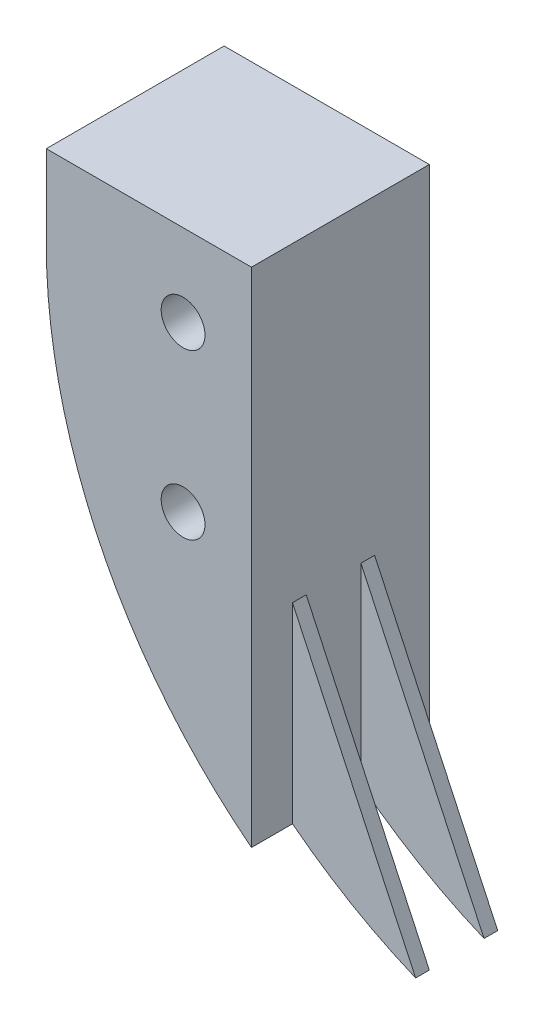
ISO-10303-21;
HEADER;
FILE_DESCRIPTION(('STEP AP214'),'2;1');
FILE_NAME('part.step','',(''),(''),'','','');
FILE_SCHEMA(('AUTOMOTIVE_DESIGN { 1 0 10303 214 1 1 1 1 }'));
ENDSEC;
DATA;
#1=APPLICATION_CONTEXT('core data for automotive mechanical design processes');
#2=APPLICATION_PROTOCOL_DEFINITION('international standard','automotive_design',2000,#1);
#3=PRODUCT_CONTEXT('',#1,'mechanical');
#4=PRODUCT('Part','Part','',(#3));
#5=PRODUCT_RELATED_PRODUCT_CATEGORY('part','',(#4));
#6=PRODUCT_DEFINITION_FORMATION('','',#4);
#7=PRODUCT_DEFINITION_CONTEXT('part definition',#1,'design');
#8=PRODUCT_DEFINITION('design','',#6,#7);
#9=PRODUCT_DEFINITION_SHAPE('','',#8);
#10=(LENGTH_UNIT() NAMED_UNIT(*) SI_UNIT(.MILLI.,.METRE.));
#11=(NAMED_UNIT(*) PLANE_ANGLE_UNIT() SI_UNIT($,.RADIAN.));
#12=(NAMED_UNIT(*) SI_UNIT($,.STERADIAN.) SOLID_ANGLE_UNIT());
#13=UNCERTAINTY_MEASURE_WITH_UNIT(LENGTH_MEASURE(1.E-05),#10,'distance_accuracy_value','');
#14=(GEOMETRIC_REPRESENTATION_CONTEXT(3) GLOBAL_UNCERTAINTY_ASSIGNED_CONTEXT((#13)) GLOBAL_UNIT_ASSIGNED_CONTEXT((#10,
#11,#12)) REPRESENTATION_CONTEXT('',''));
#15=CARTESIAN_POINT('',(0.,0.,0.));
#16=DIRECTION('',(0.,0.,1.));
#17=DIRECTION('',(1.,0.,0.));
#18=AXIS2_PLACEMENT_3D('',#15,#16,#17);
#19=CARTESIAN_POINT('',(23.,71.,26.3424433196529));
#20=DIRECTION('',(-1.,0.,0.));
#21=DIRECTION('',(0.,0.,1.));
#22=AXIS2_PLACEMENT_3D('',#19,#20,#21);
#23=PLANE('',#22);
#24=DIRECTION('',(0.,-1.,0.));
#25=VECTOR('',#24,1.);
#26=CARTESIAN_POINT('',(23.,59.6295738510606,2.));
#27=LINE('',#26,#25);
#28=CARTESIAN_POINT('',(23.,59.6295738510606,2.));
#29=VERTEX_POINT('',#28);
#30=CARTESIAN_POINT('',(23.,52.6295738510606,2.));
#31=VERTEX_POINT('',#30);
#32=EDGE_CURVE('E143',#29,#31,#27,.T.);
#33=ORIENTED_EDGE('',*,*,#32,.T.);
#34=DIRECTION('',(0.,0.,-1.));
#35=VECTOR('',#34,1.);
#36=CARTESIAN_POINT('',(23.,52.6295738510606,26.3424433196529));
#37=LINE('',#36,#35);
#38=CARTESIAN_POINT('',(23.,52.6295738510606,0.));
#39=VERTEX_POINT('',#38);
#40=EDGE_CURVE('E39',#31,#39,#37,.T.);
#41=ORIENTED_EDGE('',*,*,#40,.T.);
#42=DIRECTION('',(0.,1.,0.));
#43=VECTOR('',#42,1.);
#44=CARTESIAN_POINT('',(23.,71.,0.));
#45=LINE('',#44,#43);
#46=CARTESIAN_POINT('',(23.,71.,0.));
#47=VERTEX_POINT('',#46);
#48=EDGE_CURVE('E197',#39,#47,#45,.T.);
#49=ORIENTED_EDGE('',*,*,#48,.T.);
#50=DIRECTION('',(0.,0.,-1.));
#51=VECTOR('',#50,1.);
#52=CARTESIAN_POINT('',(23.,71.,26.3424433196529));
#53=LINE('',#52,#51);
#54=CARTESIAN_POINT('',(23.,71.,6.5));
#55=VERTEX_POINT('',#54);
#56=EDGE_CURVE('E201',#55,#47,#53,.T.);
#57=ORIENTED_EDGE('',*,*,#56,.F.);
#58=DIRECTION('',(0.,1.,0.));
#59=VECTOR('',#58,1.);
#60=CARTESIAN_POINT('',(23.,71.,6.5));
#61=LINE('',#60,#59);
#62=CARTESIAN_POINT('',(23.,52.6295738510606,6.5));
#63=VERTEX_POINT('',#62);
#64=EDGE_CURVE('E45',#63,#55,#61,.T.);
#65=ORIENTED_EDGE('',*,*,#64,.F.);
#66=CARTESIAN_POINT('',(23.,52.6295738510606,5.));
#67=VERTEX_POINT('',#66);
#68=EDGE_CURVE('E190',#63,#67,#37,.T.);
#69=ORIENTED_EDGE('',*,*,#68,.T.);
#70=DIRECTION('',(0.,-1.,0.));
#71=VECTOR('',#70,1.);
#72=CARTESIAN_POINT('',(23.,59.6295738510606,5.));
#73=LINE('',#72,#71);
#74=CARTESIAN_POINT('',(23.,59.6295738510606,5.));
#75=VERTEX_POINT('',#74);
#76=EDGE_CURVE('E173',#75,#67,#73,.T.);
#77=ORIENTED_EDGE('',*,*,#76,.F.);
#78=DIRECTION('',(0.,0.,1.));
#79=VECTOR('',#78,1.);
#80=CARTESIAN_POINT('',(23.,59.6295738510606,4.5));
#81=LINE('',#80,#79);
#82=CARTESIAN_POINT('',(23.,59.6295738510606,4.5));
#83=VERTEX_POINT('',#82);
#84=EDGE_CURVE('E236',#83,#75,#81,.T.);
#85=ORIENTED_EDGE('',*,*,#84,.F.);
#86=DIRECTION('',(0.,-1.,0.));
#87=VECTOR('',#86,1.);
#88=CARTESIAN_POINT('',(23.,59.6295738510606,4.5));
#89=LINE('',#88,#87);
#90=CARTESIAN_POINT('',(23.,52.6295738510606,4.5));
#91=VERTEX_POINT('',#90);
#92=EDGE_CURVE('E161',#83,#91,#89,.T.);
#93=ORIENTED_EDGE('',*,*,#92,.T.);
#94=CARTESIAN_POINT('',(23.,52.6295738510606,2.5));
#95=VERTEX_POINT('',#94);
#96=EDGE_CURVE('E198',#91,#95,#37,.T.);
#97=ORIENTED_EDGE('',*,*,#96,.T.);
#98=DIRECTION('',(0.,-1.,0.));
#99=VECTOR('',#98,1.);
#100=CARTESIAN_POINT('',(23.,59.6295738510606,2.5));
#101=LINE('',#100,#99);
#102=CARTESIAN_POINT('',(23.,59.6295738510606,2.5));
#103=VERTEX_POINT('',#102);
#104=EDGE_CURVE('E58',#103,#95,#101,.T.);
#105=ORIENTED_EDGE('',*,*,#104,.F.);
#106=DIRECTION('',(0.,0.,1.));
#107=VECTOR('',#106,1.);
#108=CARTESIAN_POINT('',(23.,59.6295738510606,2.));
#109=LINE('',#108,#107);
#110=EDGE_CURVE('E53',#29,#103,#109,.T.);
#111=ORIENTED_EDGE('',*,*,#110,.F.);
#112=EDGE_LOOP('',(#33,#41,#49,#57,#65,#69,#77,#85,#93,#97,#105,#111));
#113=FACE_BOUND('',#112,.T.);
#114=ADVANCED_FACE('F35',(#113),#23,.F.);
#115=CARTESIAN_POINT('',(35.,68.,26.3424433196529));
#116=DIRECTION('',(0.,0.,-1.));
#117=DIRECTION('',(-1.,0.,0.));
#118=AXIS2_PLACEMENT_3D('',#115,#116,#117);
#119=CYLINDRICAL_SURFACE('',#118,19.5);
#120=CARTESIAN_POINT('',(35.,68.,6.5));
#121=DIRECTION('',(0.,0.,1.));
#122=DIRECTION('',(1.,0.,0.));
#123=AXIS2_PLACEMENT_3D('',#120,#121,#122);
#124=CIRCLE('',#123,19.5);
#125=CARTESIAN_POINT('',(15.5,68.,6.5));
#126=VERTEX_POINT('',#125);
#127=EDGE_CURVE('E231',#126,#63,#124,.T.);
#128=ORIENTED_EDGE('',*,*,#127,.F.);
#129=DIRECTION('',(0.,0.,-1.));
#130=VECTOR('',#129,1.);
#131=CARTESIAN_POINT('',(15.5,68.,26.3424433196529));
#132=LINE('',#131,#130);
#133=CARTESIAN_POINT('',(15.5,68.,0.));
#134=VERTEX_POINT('',#133);
#135=EDGE_CURVE('E205',#126,#134,#132,.T.);
#136=ORIENTED_EDGE('',*,*,#135,.T.);
#137=CARTESIAN_POINT('',(35.,68.,0.));
#138=DIRECTION('',(0.,0.,1.));
#139=DIRECTION('',(1.,0.,0.));
#140=AXIS2_PLACEMENT_3D('',#137,#138,#139);
#141=CIRCLE('',#140,19.5);
#142=EDGE_CURVE('E228',#134,#39,#141,.T.);
#143=ORIENTED_EDGE('',*,*,#142,.T.);
#144=ORIENTED_EDGE('',*,*,#40,.F.);
#145=CARTESIAN_POINT('',(35.,68.,2.));
#146=DIRECTION('',(0.,0.,1.));
#147=DIRECTION('',(1.,0.,0.));
#148=AXIS2_PLACEMENT_3D('',#145,#146,#147);
#149=CIRCLE('',#148,19.5);
#150=CARTESIAN_POINT('',(27.5,50.,2.));
#151=VERTEX_POINT('',#150);
#152=EDGE_CURVE('E146',#31,#151,#149,.T.);
#153=ORIENTED_EDGE('',*,*,#152,.T.);
#154=DIRECTION('',(0.,0.,1.));
#155=VECTOR('',#154,1.);
#156=CARTESIAN_POINT('',(27.5,50.,2.));
#157=LINE('',#156,#155);
#158=CARTESIAN_POINT('',(27.5,50.,2.5));
#159=VERTEX_POINT('',#158);
#160=EDGE_CURVE('E154',#151,#159,#157,.T.);
#161=ORIENTED_EDGE('',*,*,#160,.T.);
#162=CARTESIAN_POINT('',(35.,68.,2.5));
#163=DIRECTION('',(0.,0.,1.));
#164=DIRECTION('',(1.,0.,0.));
#165=AXIS2_PLACEMENT_3D('',#162,#163,#164);
#166=CIRCLE('',#165,19.5);
#167=EDGE_CURVE('E144',#95,#159,#166,.T.);
#168=ORIENTED_EDGE('',*,*,#167,.F.);
#169=ORIENTED_EDGE('',*,*,#96,.F.);
#170=CARTESIAN_POINT('',(35.,68.,4.5));
#171=DIRECTION('',(0.,0.,1.));
#172=DIRECTION('',(1.,0.,0.));
#173=AXIS2_PLACEMENT_3D('',#170,#171,#172);
#174=CIRCLE('',#173,19.5);
#175=CARTESIAN_POINT('',(27.5,50.,4.5));
#176=VERTEX_POINT('',#175);
#177=EDGE_CURVE('E170',#91,#176,#174,.T.);
#178=ORIENTED_EDGE('',*,*,#177,.T.);
#179=DIRECTION('',(0.,0.,1.));
#180=VECTOR('',#179,1.);
#181=CARTESIAN_POINT('',(27.5,50.,4.5));
#182=LINE('',#181,#180);
#183=CARTESIAN_POINT('',(27.5,50.,5.));
#184=VERTEX_POINT('',#183);
#185=EDGE_CURVE('E193',#176,#184,#182,.T.);
#186=ORIENTED_EDGE('',*,*,#185,.T.);
#187=CARTESIAN_POINT('',(35.,68.,5.));
#188=DIRECTION('',(0.,0.,1.));
#189=DIRECTION('',(1.,0.,0.));
#190=AXIS2_PLACEMENT_3D('',#187,#188,#189);
#191=CIRCLE('',#190,19.5);
#192=EDGE_CURVE('E162',#67,#184,#191,.T.);
#193=ORIENTED_EDGE('',*,*,#192,.F.);
#194=ORIENTED_EDGE('',*,*,#68,.F.);
#195=EDGE_LOOP('',(#128,#136,#143,#144,#153,#161,#168,#169,#178,#186,#193,#194));
#196=FACE_BOUND('',#195,.T.);
#197=ADVANCED_FACE('F189',(#196),#119,.T.);
#198=CARTESIAN_POINT('',(23.,71.,26.3424433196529));
#199=DIRECTION('',(0.,-1.,0.));
#200=DIRECTION('',(0.,0.,-1.));
#201=AXIS2_PLACEMENT_3D('',#198,#199,#200);
#202=PLANE('',#201);
#203=DIRECTION('',(-1.,0.,0.));
#204=VECTOR('',#203,1.);
#205=CARTESIAN_POINT('',(23.,71.,6.5));
#206=LINE('',#205,#204);
#207=CARTESIAN_POINT('',(15.5,71.,6.5));
#208=VERTEX_POINT('',#207);
#209=EDGE_CURVE('E11',#55,#208,#206,.T.);
#210=ORIENTED_EDGE('',*,*,#209,.F.);
#211=ORIENTED_EDGE('',*,*,#56,.T.);
#212=DIRECTION('',(-1.,0.,0.));
#213=VECTOR('',#212,1.);
#214=CARTESIAN_POINT('',(23.,71.,0.));
#215=LINE('',#214,#213);
#216=CARTESIAN_POINT('',(15.5,71.,0.));
#217=VERTEX_POINT('',#216);
#218=EDGE_CURVE('E214',#47,#217,#215,.T.);
#219=ORIENTED_EDGE('',*,*,#218,.T.);
#220=DIRECTION('',(0.,0.,-1.));
#221=VECTOR('',#220,1.);
#222=CARTESIAN_POINT('',(15.5,71.,26.3424433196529));
#223=LINE('',#222,#221);
#224=EDGE_CURVE('E215',#208,#217,#223,.T.);
#225=ORIENTED_EDGE('',*,*,#224,.F.);
#226=EDGE_LOOP('',(#210,#211,#219,#225));
#227=FACE_BOUND('',#226,.T.);
#228=ADVANCED_FACE('F263',(#227),#202,.F.);
#229=CARTESIAN_POINT('',(15.5,71.,26.3424433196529));
#230=DIRECTION('',(1.,0.,0.));
#231=DIRECTION('',(0.,0.,-1.));
#232=AXIS2_PLACEMENT_3D('',#229,#230,#231);
#233=PLANE('',#232);
#234=DIRECTION('',(0.,-1.,0.));
#235=VECTOR('',#234,1.);
#236=CARTESIAN_POINT('',(15.5,71.,6.5));
#237=LINE('',#236,#235);
#238=EDGE_CURVE('E210',#208,#126,#237,.T.);
#239=ORIENTED_EDGE('',*,*,#238,.F.);
#240=ORIENTED_EDGE('',*,*,#224,.T.);
#241=DIRECTION('',(0.,-1.,0.));
#242=VECTOR('',#241,1.);
#243=CARTESIAN_POINT('',(15.5,71.,0.));
#244=LINE('',#243,#242);
#245=EDGE_CURVE('E216',#217,#134,#244,.T.);
#246=ORIENTED_EDGE('',*,*,#245,.T.);
#247=ORIENTED_EDGE('',*,*,#135,.F.);
#248=EDGE_LOOP('',(#239,#240,#246,#247));
#249=FACE_BOUND('',#248,.T.);
#250=ADVANCED_FACE('F234',(#249),#233,.F.);
#251=CARTESIAN_POINT('',(35.,68.,0.));
#252=DIRECTION('',(0.,0.,1.));
#253=DIRECTION('',(1.,0.,0.));
#254=AXIS2_PLACEMENT_3D('',#251,#252,#253);
#255=PLANE('',#254);
#256=ORIENTED_EDGE('',*,*,#142,.F.);
#257=ORIENTED_EDGE('',*,*,#245,.F.);
#258=ORIENTED_EDGE('',*,*,#218,.F.);
#259=ORIENTED_EDGE('',*,*,#48,.F.);
#260=EDGE_LOOP('',(#256,#257,#258,#259));
#261=FACE_BOUND('',#260,.T.);
#262=ADVANCED_FACE('F254',(#261),#255,.F.);
#263=CARTESIAN_POINT('',(30.,56.638888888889,6.5));
#264=DIRECTION('',(0.,0.,1.));
#265=DIRECTION('',(1.,0.,0.));
#266=AXIS2_PLACEMENT_3D('',#263,#264,#265);
#267=PLANE('',#266);
#268=CARTESIAN_POINT('',(20.5,68.,6.5));
#269=DIRECTION('',(0.,0.,1.));
#270=DIRECTION('',(1.,0.,0.));
#271=AXIS2_PLACEMENT_3D('',#268,#269,#270);
#272=CIRCLE('',#271,0.799999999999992);
#273=CARTESIAN_POINT('',(21.3,68.,6.5));
#274=VERTEX_POINT('',#273);
#275=EDGE_CURVE('E129',#274,#274,#272,.T.);
#276=ORIENTED_EDGE('',*,*,#275,.F.);
#277=EDGE_LOOP('',(#276));
#278=FACE_BOUND('',#277,.T.);
#279=CARTESIAN_POINT('',(20.5,62.,6.5));
#280=DIRECTION('',(0.,0.,1.));
#281=DIRECTION('',(1.,0.,0.));
#282=AXIS2_PLACEMENT_3D('',#279,#280,#281);
#283=CIRCLE('',#282,0.799999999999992);
#284=CARTESIAN_POINT('',(21.3,62.,6.5));
#285=VERTEX_POINT('',#284);
#286=EDGE_CURVE('E128',#285,#285,#283,.T.);
#287=ORIENTED_EDGE('',*,*,#286,.F.);
#288=EDGE_LOOP('',(#287));
#289=FACE_BOUND('',#288,.T.);
#290=ORIENTED_EDGE('',*,*,#238,.T.);
#291=ORIENTED_EDGE('',*,*,#127,.T.);
#292=ORIENTED_EDGE('',*,*,#64,.T.);
#293=ORIENTED_EDGE('',*,*,#209,.T.);
#294=EDGE_LOOP('',(#290,#291,#292,#293));
#295=FACE_BOUND('',#294,.T.);
#296=ADVANCED_FACE('F37',(#278,#289,#295),#267,.T.);
#297=CARTESIAN_POINT('',(23.,59.6295738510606,4.5));
#298=DIRECTION('',(0.905959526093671,0.423364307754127,0.));
#299=DIRECTION('',(-0.423364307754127,0.905959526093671,0.));
#300=AXIS2_PLACEMENT_3D('',#297,#298,#299);
#301=PLANE('',#300);
#302=DIRECTION('',(-0.423364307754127,0.905959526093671,0.));
#303=VECTOR('',#302,1.);
#304=CARTESIAN_POINT('',(23.,59.6295738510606,5.));
#305=LINE('',#304,#303);
#306=EDGE_CURVE('E156',#184,#75,#305,.T.);
#307=ORIENTED_EDGE('',*,*,#306,.F.);
#308=ORIENTED_EDGE('',*,*,#185,.F.);
#309=DIRECTION('',(-0.423364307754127,0.905959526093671,0.));
#310=VECTOR('',#309,1.);
#311=CARTESIAN_POINT('',(23.,59.6295738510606,4.5));
#312=LINE('',#311,#310);
#313=EDGE_CURVE('E158',#176,#83,#312,.T.);
#314=ORIENTED_EDGE('',*,*,#313,.T.);
#315=ORIENTED_EDGE('',*,*,#84,.T.);
#316=EDGE_LOOP('',(#307,#308,#314,#315));
#317=FACE_BOUND('',#316,.T.);
#318=ADVANCED_FACE('F261',(#317),#301,.T.);
#319=CARTESIAN_POINT('',(35.,68.,4.5));
#320=DIRECTION('',(0.,0.,1.));
#321=DIRECTION('',(1.,0.,0.));
#322=AXIS2_PLACEMENT_3D('',#319,#320,#321);
#323=PLANE('',#322);
#324=ORIENTED_EDGE('',*,*,#313,.F.);
#325=ORIENTED_EDGE('',*,*,#177,.F.);
#326=ORIENTED_EDGE('',*,*,#92,.F.);
#327=EDGE_LOOP('',(#324,#325,#326));
#328=FACE_BOUND('',#327,.T.);
#329=ADVANCED_FACE('F242',(#328),#323,.F.);
#330=CARTESIAN_POINT('',(35.,68.,5.));
#331=DIRECTION('',(0.,0.,1.));
#332=DIRECTION('',(1.,0.,0.));
#333=AXIS2_PLACEMENT_3D('',#330,#331,#332);
#334=PLANE('',#333);
#335=ORIENTED_EDGE('',*,*,#306,.T.);
#336=ORIENTED_EDGE('',*,*,#76,.T.);
#337=ORIENTED_EDGE('',*,*,#192,.T.);
#338=EDGE_LOOP('',(#335,#336,#337));
#339=FACE_BOUND('',#338,.T.);
#340=ADVANCED_FACE('F182',(#339),#334,.T.);
#341=CARTESIAN_POINT('',(23.,59.6295738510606,2.));
#342=DIRECTION('',(0.905959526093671,0.423364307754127,0.));
#343=DIRECTION('',(-0.423364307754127,0.905959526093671,0.));
#344=AXIS2_PLACEMENT_3D('',#341,#342,#343);
#345=PLANE('',#344);
#346=DIRECTION('',(-0.423364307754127,0.905959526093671,0.));
#347=VECTOR('',#346,1.);
#348=CARTESIAN_POINT('',(23.,59.6295738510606,2.5));
#349=LINE('',#348,#347);
#350=EDGE_CURVE('E139',#159,#103,#349,.T.);
#351=ORIENTED_EDGE('',*,*,#350,.F.);
#352=ORIENTED_EDGE('',*,*,#160,.F.);
#353=DIRECTION('',(-0.423364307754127,0.905959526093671,0.));
#354=VECTOR('',#353,1.);
#355=CARTESIAN_POINT('',(23.,59.6295738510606,2.));
#356=LINE('',#355,#354);
#357=EDGE_CURVE('E140',#151,#29,#356,.T.);
#358=ORIENTED_EDGE('',*,*,#357,.T.);
#359=ORIENTED_EDGE('',*,*,#110,.T.);
#360=EDGE_LOOP('',(#351,#352,#358,#359));
#361=FACE_BOUND('',#360,.T.);
#362=ADVANCED_FACE('F249',(#361),#345,.T.);
#363=CARTESIAN_POINT('',(35.,68.,2.));
#364=DIRECTION('',(0.,0.,1.));
#365=DIRECTION('',(1.,0.,0.));
#366=AXIS2_PLACEMENT_3D('',#363,#364,#365);
#367=PLANE('',#366);
#368=ORIENTED_EDGE('',*,*,#357,.F.);
#369=ORIENTED_EDGE('',*,*,#152,.F.);
#370=ORIENTED_EDGE('',*,*,#32,.F.);
#371=EDGE_LOOP('',(#368,#369,#370));
#372=FACE_BOUND('',#371,.T.);
#373=ADVANCED_FACE('F251',(#372),#367,.F.);
#374=CARTESIAN_POINT('',(35.,68.,2.5));
#375=DIRECTION('',(0.,0.,1.));
#376=DIRECTION('',(1.,0.,0.));
#377=AXIS2_PLACEMENT_3D('',#374,#375,#376);
#378=PLANE('',#377);
#379=ORIENTED_EDGE('',*,*,#350,.T.);
#380=ORIENTED_EDGE('',*,*,#104,.T.);
#381=ORIENTED_EDGE('',*,*,#167,.T.);
#382=EDGE_LOOP('',(#379,#380,#381));
#383=FACE_BOUND('',#382,.T.);
#384=ADVANCED_FACE('F244',(#383),#378,.T.);
#385=CARTESIAN_POINT('',(20.5,62.,2.5));
#386=DIRECTION('',(0.,0.,1.));
#387=DIRECTION('',(1.,0.,0.));
#388=AXIS2_PLACEMENT_3D('',#385,#386,#387);
#389=CONICAL_SURFACE('',#388,0.799999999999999,1.02974425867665);
#390=CARTESIAN_POINT('',(20.5,62.,2.01931150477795));
#391=VERTEX_POINT('',#390);
#392=VERTEX_LOOP('',#391);
#393=FACE_BOUND('',#392,.T.);
#394=CARTESIAN_POINT('',(20.5,62.,2.5));
#395=DIRECTION('',(0.,0.,1.));
#396=DIRECTION('',(1.,0.,0.));
#397=AXIS2_PLACEMENT_3D('',#394,#395,#396);
#398=CIRCLE('',#397,0.799999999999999);
#399=CARTESIAN_POINT('',(21.3,62.,2.5));
#400=VERTEX_POINT('',#399);
#401=EDGE_CURVE('E132',#400,#400,#398,.T.);
#402=ORIENTED_EDGE('',*,*,#401,.T.);
#403=EDGE_LOOP('',(#402));
#404=FACE_BOUND('',#403,.T.);
#405=ADVANCED_FACE('F343',(#393,#404),#389,.F.);
#406=CARTESIAN_POINT('',(20.5,62.,6.5));
#407=DIRECTION('',(0.,0.,1.));
#408=DIRECTION('',(1.,0.,0.));
#409=AXIS2_PLACEMENT_3D('',#406,#407,#408);
#410=CYLINDRICAL_SURFACE('',#409,0.799999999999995);
#411=ORIENTED_EDGE('',*,*,#401,.F.);
#412=EDGE_LOOP('',(#411));
#413=FACE_BOUND('',#412,.T.);
#414=ORIENTED_EDGE('',*,*,#286,.T.);
#415=EDGE_LOOP('',(#414));
#416=FACE_BOUND('',#415,.T.);
#417=ADVANCED_FACE('F122',(#413,#416),#410,.F.);
#418=CARTESIAN_POINT('',(20.5,68.,2.5));
#419=DIRECTION('',(0.,0.,1.));
#420=DIRECTION('',(1.,0.,0.));
#421=AXIS2_PLACEMENT_3D('',#418,#419,#420);
#422=CONICAL_SURFACE('',#421,0.799999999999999,1.02974425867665);
#423=CARTESIAN_POINT('',(20.5,68.,2.01931150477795));
#424=VERTEX_POINT('',#423);
#425=VERTEX_LOOP('',#424);
#426=FACE_BOUND('',#425,.T.);
#427=CARTESIAN_POINT('',(20.5,68.,2.5));
#428=DIRECTION('',(0.,0.,1.));
#429=DIRECTION('',(1.,0.,0.));
#430=AXIS2_PLACEMENT_3D('',#427,#428,#429);
#431=CIRCLE('',#430,0.799999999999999);
#432=CARTESIAN_POINT('',(21.3,68.,2.5));
#433=VERTEX_POINT('',#432);
#434=EDGE_CURVE('E126',#433,#433,#431,.T.);
#435=ORIENTED_EDGE('',*,*,#434,.T.);
#436=EDGE_LOOP('',(#435));
#437=FACE_BOUND('',#436,.T.);
#438=ADVANCED_FACE('F118',(#426,#437),#422,.F.);
#439=CARTESIAN_POINT('',(20.5,68.,6.5));
#440=DIRECTION('',(0.,0.,1.));
#441=DIRECTION('',(1.,0.,0.));
#442=AXIS2_PLACEMENT_3D('',#439,#440,#441);
#443=CYLINDRICAL_SURFACE('',#442,0.799999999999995);
#444=ORIENTED_EDGE('',*,*,#434,.F.);
#445=EDGE_LOOP('',(#444));
#446=FACE_BOUND('',#445,.T.);
#447=ORIENTED_EDGE('',*,*,#275,.T.);
#448=EDGE_LOOP('',(#447));
#449=FACE_BOUND('',#448,.T.);
#450=ADVANCED_FACE('F121',(#446,#449),#443,.F.);
#451=CLOSED_SHELL('',(#114,#197,#228,#250,#262,#296,#318,#329,#340,#362,#373,#384,#405,#417,
#438,#450));
#452=MANIFOLD_SOLID_BREP('B2',#451);
#453=ADVANCED_BREP_SHAPE_REPRESENTATION('',(#18,#452),#14);
#454=SHAPE_DEFINITION_REPRESENTATION(#9,#453);
ENDSEC;
END-ISO-10303-21;
